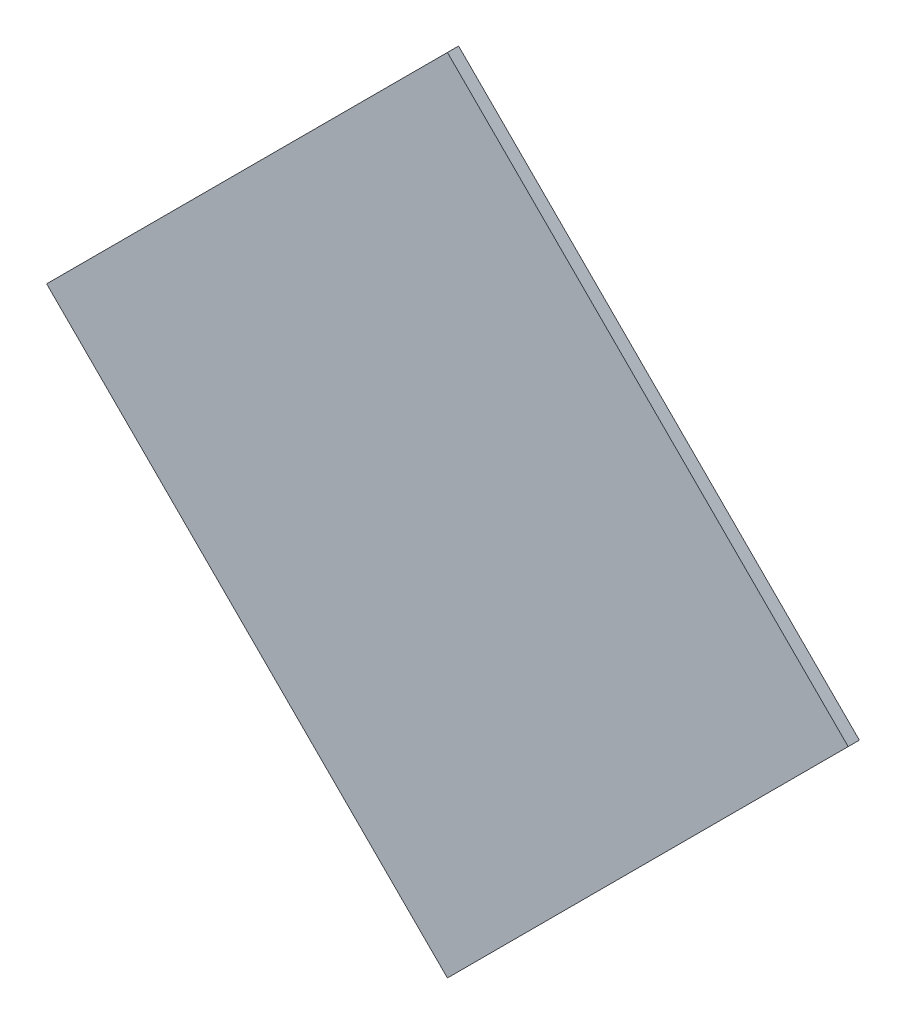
ISO-10303-21;
HEADER;
FILE_DESCRIPTION(('STEP AP214'),'2;1');
FILE_NAME('part.step','',(''),(''),'','','');
FILE_SCHEMA(('AUTOMOTIVE_DESIGN { 1 0 10303 214 1 1 1 1 }'));
ENDSEC;
DATA;
#1=APPLICATION_CONTEXT('core data for automotive mechanical design processes');
#2=APPLICATION_PROTOCOL_DEFINITION('international standard','automotive_design',2000,#1);
#3=PRODUCT_CONTEXT('',#1,'mechanical');
#4=PRODUCT('Part','Part','',(#3));
#5=PRODUCT_RELATED_PRODUCT_CATEGORY('part','',(#4));
#6=PRODUCT_DEFINITION_FORMATION('','',#4);
#7=PRODUCT_DEFINITION_CONTEXT('part definition',#1,'design');
#8=PRODUCT_DEFINITION('design','',#6,#7);
#9=PRODUCT_DEFINITION_SHAPE('','',#8);
#10=(LENGTH_UNIT() NAMED_UNIT(*) SI_UNIT(.MILLI.,.METRE.));
#11=(NAMED_UNIT(*) PLANE_ANGLE_UNIT() SI_UNIT($,.RADIAN.));
#12=(NAMED_UNIT(*) SI_UNIT($,.STERADIAN.) SOLID_ANGLE_UNIT());
#13=UNCERTAINTY_MEASURE_WITH_UNIT(LENGTH_MEASURE(1.E-05),#10,'distance_accuracy_value','');
#14=(GEOMETRIC_REPRESENTATION_CONTEXT(3) GLOBAL_UNCERTAINTY_ASSIGNED_CONTEXT((#13)) GLOBAL_UNIT_ASSIGNED_CONTEXT((#10,
#11,#12)) REPRESENTATION_CONTEXT('',''));
#15=CARTESIAN_POINT('',(0.,0.,0.));
#16=DIRECTION('',(0.,0.,1.));
#17=DIRECTION('',(1.,0.,0.));
#18=AXIS2_PLACEMENT_3D('',#15,#16,#17);
#19=CARTESIAN_POINT('',(0.35920934,2.540000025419E-06,0.));
#20=DIRECTION('',(0.707109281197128,-0.707104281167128,0.));
#21=DIRECTION('',(-0.707104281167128,-0.707109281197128,0.));
#22=AXIS2_PLACEMENT_3D('',#19,#20,#21);
#23=PLANE('',#22);
#24=DIRECTION('',(0.,0.,1.));
#25=VECTOR('',#24,1.);
#26=CARTESIAN_POINT('',(0.35920934,2.540000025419E-06,0.));
#27=LINE('',#26,#25);
#28=CARTESIAN_POINT('',(0.35920934,2.540000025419E-06,0.));
#29=VERTEX_POINT('',#28);
#30=CARTESIAN_POINT('',(0.35920934,2.540000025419E-06,0.00999998));
#31=VERTEX_POINT('',#30);
#32=EDGE_CURVE('E11',#29,#31,#27,.T.);
#33=ORIENTED_EDGE('',*,*,#32,.T.);
#34=DIRECTION('',(-0.707104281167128,-0.707109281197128,0.));
#35=VECTOR('',#34,1.);
#36=CARTESIAN_POINT('',(0.35920934,2.540000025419E-06,0.00999998));
#37=LINE('',#36,#35);
#38=CARTESIAN_POINT('',(2.540000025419E-06,-0.3592068,0.00999998));
#39=VERTEX_POINT('',#38);
#40=EDGE_CURVE('E25',#31,#39,#37,.T.);
#41=ORIENTED_EDGE('',*,*,#40,.T.);
#42=DIRECTION('',(0.,0.,1.));
#43=VECTOR('',#42,1.);
#44=CARTESIAN_POINT('',(2.540000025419E-06,-0.3592068,0.));
#45=LINE('',#44,#43);
#46=CARTESIAN_POINT('',(2.540000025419E-06,-0.3592068,0.));
#47=VERTEX_POINT('',#46);
#48=EDGE_CURVE('E73',#47,#39,#45,.T.);
#49=ORIENTED_EDGE('',*,*,#48,.F.);
#50=DIRECTION('',(-0.707104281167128,-0.707109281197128,0.));
#51=VECTOR('',#50,1.);
#52=CARTESIAN_POINT('',(0.35920934,2.540000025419E-06,0.));
#53=LINE('',#52,#51);
#54=EDGE_CURVE('E99',#29,#47,#53,.T.);
#55=ORIENTED_EDGE('',*,*,#54,.F.);
#56=EDGE_LOOP('',(#33,#41,#49,#55));
#57=FACE_BOUND('',#56,.T.);
#58=ADVANCED_FACE('F17',(#57),#23,.T.);
#59=CARTESIAN_POINT('',(1.587500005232E-06,1.587500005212E-06,0.));
#60=DIRECTION('',(0.,0.,-1.));
#61=DIRECTION('',(-1.,0.,0.));
#62=AXIS2_PLACEMENT_3D('',#59,#60,#61);
#63=PLANE('',#62);
#64=ORIENTED_EDGE('',*,*,#54,.T.);
#65=DIRECTION('',(-0.707106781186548,0.707106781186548,0.));
#66=VECTOR('',#65,1.);
#67=CARTESIAN_POINT('',(2.540000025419E-06,-0.3592068,0.));
#68=LINE('',#67,#66);
#69=CARTESIAN_POINT('',(-0.3592068,2.540000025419E-06,0.));
#70=VERTEX_POINT('',#69);
#71=EDGE_CURVE('E95',#47,#70,#68,.T.);
#72=ORIENTED_EDGE('',*,*,#71,.T.);
#73=DIRECTION('',(0.707109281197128,0.707104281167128,0.));
#74=VECTOR('',#73,1.);
#75=CARTESIAN_POINT('',(-0.3592068,2.540000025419E-06,0.));
#76=LINE('',#75,#74);
#77=CARTESIAN_POINT('',(2.540000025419E-06,0.35920934,0.));
#78=VERTEX_POINT('',#77);
#79=EDGE_CURVE('E68',#70,#78,#76,.T.);
#80=ORIENTED_EDGE('',*,*,#79,.T.);
#81=DIRECTION('',(0.707106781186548,-0.707106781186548,0.));
#82=VECTOR('',#81,1.);
#83=CARTESIAN_POINT('',(2.540000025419E-06,0.35920934,0.));
#84=LINE('',#83,#82);
#85=EDGE_CURVE('E87',#78,#29,#84,.T.);
#86=ORIENTED_EDGE('',*,*,#85,.T.);
#87=EDGE_LOOP('',(#64,#72,#80,#86));
#88=FACE_BOUND('',#87,.T.);
#89=ADVANCED_FACE('F112',(#88),#63,.T.);
#90=CARTESIAN_POINT('',(2.540000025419E-06,0.35920934,0.));
#91=DIRECTION('',(0.707106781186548,0.707106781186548,0.));
#92=DIRECTION('',(0.707106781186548,-0.707106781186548,0.));
#93=AXIS2_PLACEMENT_3D('',#90,#91,#92);
#94=PLANE('',#93);
#95=DIRECTION('',(0.,0.,1.));
#96=VECTOR('',#95,1.);
#97=CARTESIAN_POINT('',(2.540000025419E-06,0.35920934,0.));
#98=LINE('',#97,#96);
#99=CARTESIAN_POINT('',(2.540000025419E-06,0.35920934,0.00999998));
#100=VERTEX_POINT('',#99);
#101=EDGE_CURVE('E83',#78,#100,#98,.T.);
#102=ORIENTED_EDGE('',*,*,#101,.T.);
#103=DIRECTION('',(0.707106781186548,-0.707106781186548,0.));
#104=VECTOR('',#103,1.);
#105=CARTESIAN_POINT('',(2.540000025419E-06,0.35920934,0.00999998));
#106=LINE('',#105,#104);
#107=EDGE_CURVE('E60',#100,#31,#106,.T.);
#108=ORIENTED_EDGE('',*,*,#107,.T.);
#109=ORIENTED_EDGE('',*,*,#32,.F.);
#110=ORIENTED_EDGE('',*,*,#85,.F.);
#111=EDGE_LOOP('',(#102,#108,#109,#110));
#112=FACE_BOUND('',#111,.T.);
#113=ADVANCED_FACE('F119',(#112),#94,.T.);
#114=CARTESIAN_POINT('',(1.587500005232E-06,1.587500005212E-06,0.00999998));
#115=DIRECTION('',(0.,0.,-1.));
#116=DIRECTION('',(-1.,0.,0.));
#117=AXIS2_PLACEMENT_3D('',#114,#115,#116);
#118=PLANE('',#117);
#119=ORIENTED_EDGE('',*,*,#107,.F.);
#120=DIRECTION('',(0.707109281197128,0.707104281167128,0.));
#121=VECTOR('',#120,1.);
#122=CARTESIAN_POINT('',(-0.3592068,2.540000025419E-06,0.00999998));
#123=LINE('',#122,#121);
#124=CARTESIAN_POINT('',(-0.3592068,2.540000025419E-06,0.00999998));
#125=VERTEX_POINT('',#124);
#126=EDGE_CURVE('E54',#125,#100,#123,.T.);
#127=ORIENTED_EDGE('',*,*,#126,.F.);
#128=DIRECTION('',(-0.707106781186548,0.707106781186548,0.));
#129=VECTOR('',#128,1.);
#130=CARTESIAN_POINT('',(2.540000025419E-06,-0.3592068,0.00999998));
#131=LINE('',#130,#129);
#132=EDGE_CURVE('E58',#39,#125,#131,.T.);
#133=ORIENTED_EDGE('',*,*,#132,.F.);
#134=ORIENTED_EDGE('',*,*,#40,.F.);
#135=EDGE_LOOP('',(#119,#127,#133,#134));
#136=FACE_BOUND('',#135,.T.);
#137=ADVANCED_FACE('F56',(#136),#118,.F.);
#138=CARTESIAN_POINT('',(2.540000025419E-06,-0.3592068,0.));
#139=DIRECTION('',(-0.707106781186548,-0.707106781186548,0.));
#140=DIRECTION('',(-0.707106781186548,0.707106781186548,0.));
#141=AXIS2_PLACEMENT_3D('',#138,#139,#140);
#142=PLANE('',#141);
#143=ORIENTED_EDGE('',*,*,#48,.T.);
#144=ORIENTED_EDGE('',*,*,#132,.T.);
#145=DIRECTION('',(0.,0.,1.));
#146=VECTOR('',#145,1.);
#147=CARTESIAN_POINT('',(-0.3592068,2.540000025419E-06,0.));
#148=LINE('',#147,#146);
#149=EDGE_CURVE('E66',#70,#125,#148,.T.);
#150=ORIENTED_EDGE('',*,*,#149,.F.);
#151=ORIENTED_EDGE('',*,*,#71,.F.);
#152=EDGE_LOOP('',(#143,#144,#150,#151));
#153=FACE_BOUND('',#152,.T.);
#154=ADVANCED_FACE('F72',(#153),#142,.T.);
#155=CARTESIAN_POINT('',(-0.3592068,2.540000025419E-06,0.));
#156=DIRECTION('',(-0.707104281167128,0.707109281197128,0.));
#157=DIRECTION('',(0.707109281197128,0.707104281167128,0.));
#158=AXIS2_PLACEMENT_3D('',#155,#156,#157);
#159=PLANE('',#158);
#160=ORIENTED_EDGE('',*,*,#149,.T.);
#161=ORIENTED_EDGE('',*,*,#126,.T.);
#162=ORIENTED_EDGE('',*,*,#101,.F.);
#163=ORIENTED_EDGE('',*,*,#79,.F.);
#164=EDGE_LOOP('',(#160,#161,#162,#163));
#165=FACE_BOUND('',#164,.T.);
#166=ADVANCED_FACE('F67',(#165),#159,.T.);
#167=CLOSED_SHELL('',(#58,#89,#113,#137,#154,#166));
#168=MANIFOLD_SOLID_BREP('B1',#167);
#169=ADVANCED_BREP_SHAPE_REPRESENTATION('',(#18,#168),#14);
#170=SHAPE_DEFINITION_REPRESENTATION(#9,#169);
ENDSEC;
END-ISO-10303-21;
